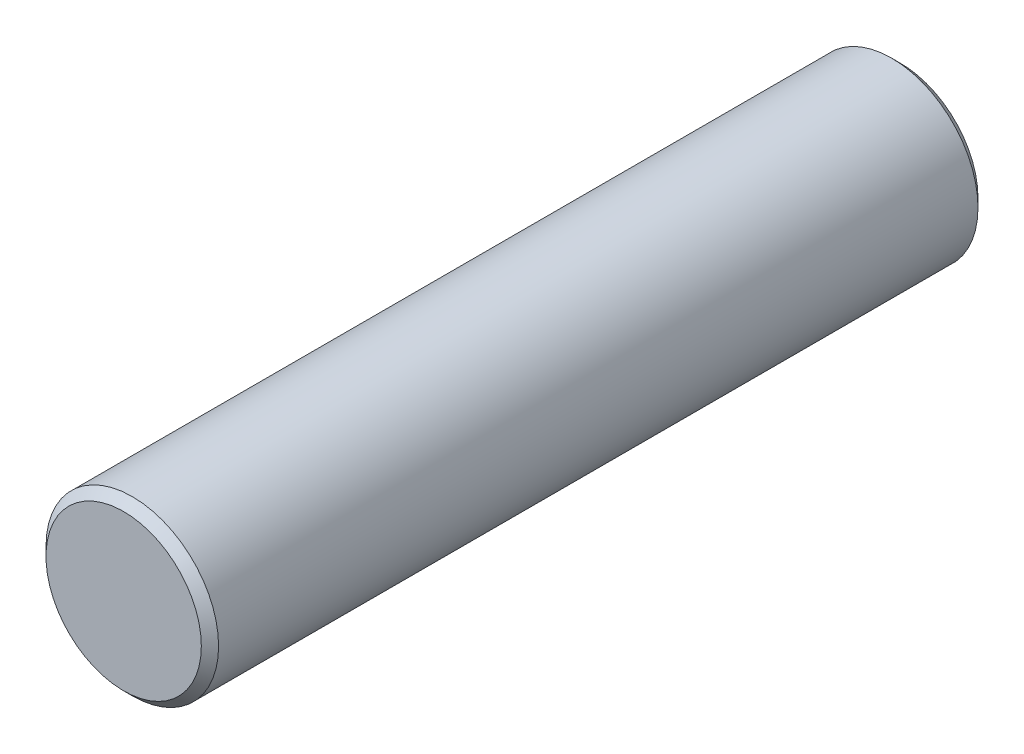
ISO-10303-21;
HEADER;
FILE_DESCRIPTION(('STEP AP214'),'2;1');
FILE_NAME('part.step','',(''),(''),'','','');
FILE_SCHEMA(('AUTOMOTIVE_DESIGN { 1 0 10303 214 1 1 1 1 }'));
ENDSEC;
DATA;
#1=APPLICATION_CONTEXT('core data for automotive mechanical design processes');
#2=APPLICATION_PROTOCOL_DEFINITION('international standard','automotive_design',2000,#1);
#3=PRODUCT_CONTEXT('',#1,'mechanical');
#4=PRODUCT('Part','Part','',(#3));
#5=PRODUCT_RELATED_PRODUCT_CATEGORY('part','',(#4));
#6=PRODUCT_DEFINITION_FORMATION('','',#4);
#7=PRODUCT_DEFINITION_CONTEXT('part definition',#1,'design');
#8=PRODUCT_DEFINITION('design','',#6,#7);
#9=PRODUCT_DEFINITION_SHAPE('','',#8);
#10=(LENGTH_UNIT() NAMED_UNIT(*) SI_UNIT(.MILLI.,.METRE.));
#11=(NAMED_UNIT(*) PLANE_ANGLE_UNIT() SI_UNIT($,.RADIAN.));
#12=(NAMED_UNIT(*) SI_UNIT($,.STERADIAN.) SOLID_ANGLE_UNIT());
#13=UNCERTAINTY_MEASURE_WITH_UNIT(LENGTH_MEASURE(1.E-05),#10,'distance_accuracy_value','');
#14=(GEOMETRIC_REPRESENTATION_CONTEXT(3) GLOBAL_UNCERTAINTY_ASSIGNED_CONTEXT((#13)) GLOBAL_UNIT_ASSIGNED_CONTEXT((#10,
#11,#12)) REPRESENTATION_CONTEXT('',''));
#15=CARTESIAN_POINT('',(0.,0.,0.));
#16=DIRECTION('',(0.,0.,1.));
#17=DIRECTION('',(1.,0.,0.));
#18=AXIS2_PLACEMENT_3D('',#15,#16,#17);
#19=CARTESIAN_POINT('',(0.,0.,18.));
#20=DIRECTION('',(0.,0.,-1.));
#21=DIRECTION('',(-1.,0.,0.));
#22=AXIS2_PLACEMENT_3D('',#19,#20,#21);
#23=CYLINDRICAL_SURFACE('',#22,2.);
#24=CARTESIAN_POINT('',(0.,0.,17.8));
#25=DIRECTION('',(0.,0.,1.));
#26=DIRECTION('',(1.,0.,0.));
#27=AXIS2_PLACEMENT_3D('',#24,#25,#26);
#28=CIRCLE('',#27,2.);
#29=CARTESIAN_POINT('',(2.,0.,17.8));
#30=VERTEX_POINT('',#29);
#31=EDGE_CURVE('E38',#30,#30,#28,.F.);
#32=ORIENTED_EDGE('',*,*,#31,.T.);
#33=EDGE_LOOP('',(#32));
#34=FACE_BOUND('',#33,.T.);
#35=CARTESIAN_POINT('',(0.,0.,0.199999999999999));
#36=DIRECTION('',(0.,0.,1.));
#37=DIRECTION('',(1.,0.,0.));
#38=AXIS2_PLACEMENT_3D('',#35,#36,#37);
#39=CIRCLE('',#38,2.);
#40=CARTESIAN_POINT('',(2.,0.,0.199999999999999));
#41=VERTEX_POINT('',#40);
#42=EDGE_CURVE('E42',#41,#41,#39,.T.);
#43=ORIENTED_EDGE('',*,*,#42,.T.);
#44=EDGE_LOOP('',(#43));
#45=FACE_BOUND('',#44,.T.);
#46=ADVANCED_FACE('F32',(#34,#45),#23,.T.);
#47=CARTESIAN_POINT('',(0.,0.,18.));
#48=DIRECTION('',(0.,0.,1.));
#49=DIRECTION('',(1.,0.,0.));
#50=AXIS2_PLACEMENT_3D('',#47,#48,#49);
#51=PLANE('',#50);
#52=CARTESIAN_POINT('',(0.,0.,18.));
#53=DIRECTION('',(0.,0.,1.));
#54=DIRECTION('',(1.,0.,0.));
#55=AXIS2_PLACEMENT_3D('',#52,#53,#54);
#56=CIRCLE('',#55,1.8);
#57=CARTESIAN_POINT('',(1.8,0.,18.));
#58=VERTEX_POINT('',#57);
#59=EDGE_CURVE('E46',#58,#58,#56,.T.);
#60=ORIENTED_EDGE('',*,*,#59,.T.);
#61=EDGE_LOOP('',(#60));
#62=FACE_BOUND('',#61,.T.);
#63=ADVANCED_FACE('F52',(#62),#51,.T.);
#64=CARTESIAN_POINT('',(0.,0.,0.));
#65=DIRECTION('',(0.,0.,1.));
#66=DIRECTION('',(1.,0.,0.));
#67=AXIS2_PLACEMENT_3D('',#64,#65,#66);
#68=PLANE('',#67);
#69=CARTESIAN_POINT('',(0.,0.,0.));
#70=DIRECTION('',(0.,0.,1.));
#71=DIRECTION('',(1.,0.,0.));
#72=AXIS2_PLACEMENT_3D('',#69,#70,#71);
#73=CIRCLE('',#72,1.8);
#74=CARTESIAN_POINT('',(1.8,0.,0.));
#75=VERTEX_POINT('',#74);
#76=EDGE_CURVE('E10',#75,#75,#73,.F.);
#77=ORIENTED_EDGE('',*,*,#76,.T.);
#78=EDGE_LOOP('',(#77));
#79=FACE_BOUND('',#78,.T.);
#80=ADVANCED_FACE('F57',(#79),#68,.F.);
#81=CARTESIAN_POINT('',(0.,0.,18.));
#82=DIRECTION('',(0.,0.,-1.));
#83=DIRECTION('',(-1.,0.,0.));
#84=AXIS2_PLACEMENT_3D('',#81,#82,#83);
#85=CONICAL_SURFACE('',#84,1.8,0.785398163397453);
#86=ORIENTED_EDGE('',*,*,#31,.F.);
#87=EDGE_LOOP('',(#86));
#88=FACE_BOUND('',#87,.T.);
#89=ORIENTED_EDGE('',*,*,#59,.F.);
#90=EDGE_LOOP('',(#89));
#91=FACE_BOUND('',#90,.T.);
#92=ADVANCED_FACE('F54',(#88,#91),#85,.T.);
#93=CARTESIAN_POINT('',(0.,0.,0.199999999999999));
#94=DIRECTION('',(0.,0.,1.));
#95=DIRECTION('',(1.,0.,0.));
#96=AXIS2_PLACEMENT_3D('',#93,#94,#95);
#97=CONICAL_SURFACE('',#96,2.,0.785398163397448);
#98=ORIENTED_EDGE('',*,*,#76,.F.);
#99=EDGE_LOOP('',(#98));
#100=FACE_BOUND('',#99,.T.);
#101=ORIENTED_EDGE('',*,*,#42,.F.);
#102=EDGE_LOOP('',(#101));
#103=FACE_BOUND('',#102,.T.);
#104=ADVANCED_FACE('F56',(#100,#103),#97,.T.);
#105=CLOSED_SHELL('',(#46,#63,#80,#92,#104));
#106=MANIFOLD_SOLID_BREP('B2',#105);
#107=ADVANCED_BREP_SHAPE_REPRESENTATION('',(#18,#106),#14);
#108=SHAPE_DEFINITION_REPRESENTATION(#9,#107);
ENDSEC;
END-ISO-10303-21;
